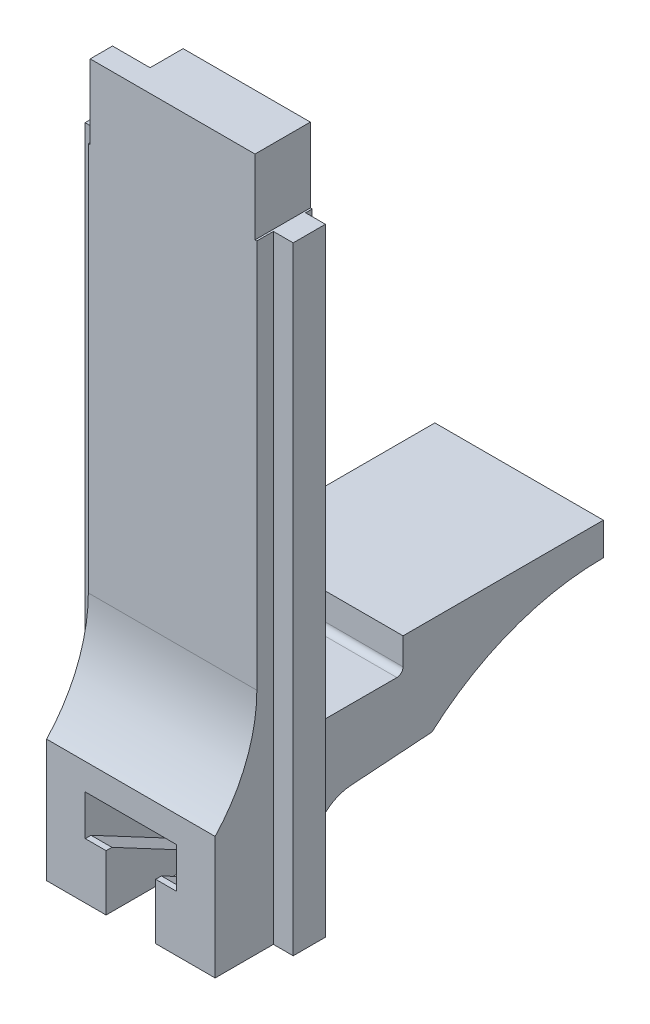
ISO-10303-21;
HEADER;
FILE_DESCRIPTION(('STEP AP214'),'2;1');
FILE_NAME('part.step','',(''),(''),'','','');
FILE_SCHEMA(('AUTOMOTIVE_DESIGN { 1 0 10303 214 1 1 1 1 }'));
ENDSEC;
DATA;
#1=APPLICATION_CONTEXT('core data for automotive mechanical design processes');
#2=APPLICATION_PROTOCOL_DEFINITION('international standard','automotive_design',2000,#1);
#3=PRODUCT_CONTEXT('',#1,'mechanical');
#4=PRODUCT('Part','Part','',(#3));
#5=PRODUCT_RELATED_PRODUCT_CATEGORY('part','',(#4));
#6=PRODUCT_DEFINITION_FORMATION('','',#4);
#7=PRODUCT_DEFINITION_CONTEXT('part definition',#1,'design');
#8=PRODUCT_DEFINITION('design','',#6,#7);
#9=PRODUCT_DEFINITION_SHAPE('','',#8);
#10=(LENGTH_UNIT() NAMED_UNIT(*) SI_UNIT(.MILLI.,.METRE.));
#11=(NAMED_UNIT(*) PLANE_ANGLE_UNIT() SI_UNIT($,.RADIAN.));
#12=(NAMED_UNIT(*) SI_UNIT($,.STERADIAN.) SOLID_ANGLE_UNIT());
#13=UNCERTAINTY_MEASURE_WITH_UNIT(LENGTH_MEASURE(1.E-05),#10,'distance_accuracy_value','');
#14=(GEOMETRIC_REPRESENTATION_CONTEXT(3) GLOBAL_UNCERTAINTY_ASSIGNED_CONTEXT((#13)) GLOBAL_UNIT_ASSIGNED_CONTEXT((#10,
#11,#12)) REPRESENTATION_CONTEXT('',''));
#15=CARTESIAN_POINT('',(0.,0.,0.));
#16=DIRECTION('',(0.,0.,1.));
#17=DIRECTION('',(1.,0.,0.));
#18=AXIS2_PLACEMENT_3D('',#15,#16,#17);
#19=CARTESIAN_POINT('',(-5.0673,42.545,5.969));
#20=DIRECTION('',(1.,0.,0.));
#21=DIRECTION('',(0.,1.,0.));
#22=AXIS2_PLACEMENT_3D('',#19,#20,#21);
#23=PLANE('',#22);
#24=DIRECTION('',(0.,0.,-1.));
#25=VECTOR('',#24,1.);
#26=CARTESIAN_POINT('',(-5.0673,42.545,5.969));
#27=LINE('',#26,#25);
#28=CARTESIAN_POINT('',(-5.0673,42.545,3.4036));
#29=VERTEX_POINT('',#28);
#30=CARTESIAN_POINT('',(-5.0673,42.545,2.032));
#31=VERTEX_POINT('',#30);
#32=EDGE_CURVE('E428',#29,#31,#27,.T.);
#33=ORIENTED_EDGE('',*,*,#32,.T.);
#34=DIRECTION('',(0.,1.,0.));
#35=VECTOR('',#34,1.);
#36=CARTESIAN_POINT('',(-5.0673,42.545,2.032));
#37=LINE('',#36,#35);
#38=CARTESIAN_POINT('',(-5.0673,38.1,2.032));
#39=VERTEX_POINT('',#38);
#40=EDGE_CURVE('E12',#39,#31,#37,.T.);
#41=ORIENTED_EDGE('',*,*,#40,.F.);
#42=DIRECTION('',(0.,0.,-1.));
#43=VECTOR('',#42,1.);
#44=CARTESIAN_POINT('',(-5.0673,38.1,5.969));
#45=LINE('',#44,#43);
#46=CARTESIAN_POINT('',(-5.0673,38.1,0.));
#47=VERTEX_POINT('',#46);
#48=EDGE_CURVE('E44',#39,#47,#45,.T.);
#49=ORIENTED_EDGE('',*,*,#48,.T.);
#50=DIRECTION('',(0.,-1.,0.));
#51=VECTOR('',#50,1.);
#52=CARTESIAN_POINT('',(-5.0673,42.545,0.));
#53=LINE('',#52,#51);
#54=CARTESIAN_POINT('',(-5.0673,37.973,0.));
#55=VERTEX_POINT('',#54);
#56=EDGE_CURVE('E414',#47,#55,#53,.T.);
#57=ORIENTED_EDGE('',*,*,#56,.T.);
#58=DIRECTION('',(0.,0.,-1.));
#59=VECTOR('',#58,1.);
#60=CARTESIAN_POINT('',(-5.0673,37.973,5.969));
#61=LINE('',#60,#59);
#62=CARTESIAN_POINT('',(-5.0673,37.973,3.4036));
#63=VERTEX_POINT('',#62);
#64=EDGE_CURVE('E422',#63,#55,#61,.T.);
#65=ORIENTED_EDGE('',*,*,#64,.F.);
#66=DIRECTION('',(0.,-1.,0.));
#67=VECTOR('',#66,1.);
#68=CARTESIAN_POINT('',(-5.06730000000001,14.0436698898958,3.4036));
#69=LINE('',#68,#67);
#70=EDGE_CURVE('E407',#29,#63,#69,.T.);
#71=ORIENTED_EDGE('',*,*,#70,.F.);
#72=EDGE_LOOP('',(#33,#41,#49,#57,#65,#71));
#73=FACE_BOUND('',#72,.T.);
#74=ADVANCED_FACE('F36',(#73),#23,.F.);
#75=CARTESIAN_POINT('',(5.1816,42.545,0.));
#76=DIRECTION('',(0.,0.,1.));
#77=DIRECTION('',(0.,-1.,0.));
#78=AXIS2_PLACEMENT_3D('',#75,#76,#77);
#79=PLANE('',#78);
#80=DIRECTION('',(-1.,0.,0.));
#81=VECTOR('',#80,1.);
#82=CARTESIAN_POINT('',(-6.4008,40.8432,0.));
#83=LINE('',#82,#81);
#84=CARTESIAN_POINT('',(4.2291,40.8432,0.));
#85=VERTEX_POINT('',#84);
#86=CARTESIAN_POINT('',(-2.7559,40.8432,0.));
#87=VERTEX_POINT('',#86);
#88=EDGE_CURVE('E344',#85,#87,#83,.T.);
#89=ORIENTED_EDGE('',*,*,#88,.T.);
#90=DIRECTION('',(0.,-1.,0.));
#91=VECTOR('',#90,1.);
#92=CARTESIAN_POINT('',(-2.7559,42.545,0.));
#93=LINE('',#92,#91);
#94=CARTESIAN_POINT('',(-2.7559,42.545,0.));
#95=VERTEX_POINT('',#94);
#96=EDGE_CURVE('E331',#95,#87,#93,.T.);
#97=ORIENTED_EDGE('',*,*,#96,.F.);
#98=DIRECTION('',(-1.,0.,0.));
#99=VECTOR('',#98,1.);
#100=CARTESIAN_POINT('',(5.1816,42.545,0.));
#101=LINE('',#100,#99);
#102=CARTESIAN_POINT('',(5.0673,42.545,0.));
#103=VERTEX_POINT('',#102);
#104=EDGE_CURVE('E342',#103,#95,#101,.T.);
#105=ORIENTED_EDGE('',*,*,#104,.F.);
#106=DIRECTION('',(0.,1.,0.));
#107=VECTOR('',#106,1.);
#108=CARTESIAN_POINT('',(5.0673,42.545,0.));
#109=LINE('',#108,#107);
#110=CARTESIAN_POINT('',(5.0673,37.973,0.));
#111=VERTEX_POINT('',#110);
#112=EDGE_CURVE('E443',#111,#103,#109,.T.);
#113=ORIENTED_EDGE('',*,*,#112,.F.);
#114=DIRECTION('',(-1.,0.,0.));
#115=VECTOR('',#114,1.);
#116=CARTESIAN_POINT('',(5.0673,37.973,0.));
#117=LINE('',#116,#115);
#118=CARTESIAN_POINT('',(5.1816,37.973,0.));
#119=VERTEX_POINT('',#118);
#120=EDGE_CURVE('E445',#119,#111,#117,.T.);
#121=ORIENTED_EDGE('',*,*,#120,.F.);
#122=DIRECTION('',(0.,1.,0.));
#123=VECTOR('',#122,1.);
#124=CARTESIAN_POINT('',(5.1816,42.545,0.));
#125=LINE('',#124,#123);
#126=CARTESIAN_POINT('',(5.1816,10.795,0.));
#127=VERTEX_POINT('',#126);
#128=EDGE_CURVE('E599',#127,#119,#125,.T.);
#129=ORIENTED_EDGE('',*,*,#128,.F.);
#130=DIRECTION('',(-1.,0.,0.));
#131=VECTOR('',#130,1.);
#132=CARTESIAN_POINT('',(5.1816,10.795,0.));
#133=LINE('',#132,#131);
#134=CARTESIAN_POINT('',(-5.1816,10.795,0.));
#135=VERTEX_POINT('',#134);
#136=EDGE_CURVE('E350',#127,#135,#133,.T.);
#137=ORIENTED_EDGE('',*,*,#136,.T.);
#138=DIRECTION('',(0.,1.,0.));
#139=VECTOR('',#138,1.);
#140=CARTESIAN_POINT('',(-5.1816,42.545,0.));
#141=LINE('',#140,#139);
#142=CARTESIAN_POINT('',(-5.1816,37.973,0.));
#143=VERTEX_POINT('',#142);
#144=EDGE_CURVE('E632',#135,#143,#141,.T.);
#145=ORIENTED_EDGE('',*,*,#144,.T.);
#146=DIRECTION('',(-1.,0.,0.));
#147=VECTOR('',#146,1.);
#148=CARTESIAN_POINT('',(-5.0673,37.973,0.));
#149=LINE('',#148,#147);
#150=EDGE_CURVE('E419',#55,#143,#149,.T.);
#151=ORIENTED_EDGE('',*,*,#150,.F.);
#152=ORIENTED_EDGE('',*,*,#56,.F.);
#153=DIRECTION('',(-1.,0.,0.));
#154=VECTOR('',#153,1.);
#155=CARTESIAN_POINT('',(-6.4008,38.1,0.));
#156=LINE('',#155,#154);
#157=CARTESIAN_POINT('',(4.2291,38.1,0.));
#158=VERTEX_POINT('',#157);
#159=EDGE_CURVE('E59',#158,#47,#156,.T.);
#160=ORIENTED_EDGE('',*,*,#159,.F.);
#161=DIRECTION('',(0.,-1.,0.));
#162=VECTOR('',#161,1.);
#163=CARTESIAN_POINT('',(4.2291,40.8432,0.));
#164=LINE('',#163,#162);
#165=EDGE_CURVE('E420',#85,#158,#164,.T.);
#166=ORIENTED_EDGE('',*,*,#165,.F.);
#167=EDGE_LOOP('',(#89,#97,#105,#113,#121,#129,#137,#145,#151,#152,#160,#166));
#168=FACE_BOUND('',#167,.T.);
#169=ADVANCED_FACE('F340',(#168),#79,.F.);
#170=CARTESIAN_POINT('',(5.1816,0.,0.));
#171=DIRECTION('',(0.,0.,1.));
#172=DIRECTION('',(1.,0.,0.));
#173=AXIS2_PLACEMENT_3D('',#170,#171,#172);
#174=PLANE('',#173);
#175=DIRECTION('',(0.,-1.,0.));
#176=VECTOR('',#175,1.);
#177=CARTESIAN_POINT('',(1.524,0.,0.));
#178=LINE('',#177,#176);
#179=CARTESIAN_POINT('',(1.524,0.660399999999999,0.));
#180=VERTEX_POINT('',#179);
#181=CARTESIAN_POINT('',(1.524,0.,0.));
#182=VERTEX_POINT('',#181);
#183=EDGE_CURVE('E543',#180,#182,#178,.T.);
#184=ORIENTED_EDGE('',*,*,#183,.F.);
#185=DIRECTION('',(1.,0.,0.));
#186=VECTOR('',#185,1.);
#187=CARTESIAN_POINT('',(5.1816,0.660399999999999,0.));
#188=LINE('',#187,#186);
#189=CARTESIAN_POINT('',(2.8067,0.660399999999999,0.));
#190=VERTEX_POINT('',#189);
#191=EDGE_CURVE('E511',#180,#190,#188,.T.);
#192=ORIENTED_EDGE('',*,*,#191,.T.);
#193=DIRECTION('',(0.,1.,0.));
#194=VECTOR('',#193,1.);
#195=CARTESIAN_POINT('',(2.8067,0.,0.));
#196=LINE('',#195,#194);
#197=CARTESIAN_POINT('',(2.8067,3.54961168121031,0.));
#198=VERTEX_POINT('',#197);
#199=EDGE_CURVE('E523',#190,#198,#196,.T.);
#200=ORIENTED_EDGE('',*,*,#199,.T.);
#201=DIRECTION('',(-1.,0.,0.));
#202=VECTOR('',#201,1.);
#203=CARTESIAN_POINT('',(5.1816,3.54961168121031,0.));
#204=LINE('',#203,#202);
#205=CARTESIAN_POINT('',(5.1816,3.54961168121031,0.));
#206=VERTEX_POINT('',#205);
#207=EDGE_CURVE('E385',#206,#198,#204,.T.);
#208=ORIENTED_EDGE('',*,*,#207,.F.);
#209=DIRECTION('',(0.,1.,0.));
#210=VECTOR('',#209,1.);
#211=CARTESIAN_POINT('',(5.1816,0.,0.));
#212=LINE('',#211,#210);
#213=CARTESIAN_POINT('',(5.1816,0.,0.));
#214=VERTEX_POINT('',#213);
#215=EDGE_CURVE('E577',#214,#206,#212,.T.);
#216=ORIENTED_EDGE('',*,*,#215,.F.);
#217=DIRECTION('',(-1.,0.,0.));
#218=VECTOR('',#217,1.);
#219=CARTESIAN_POINT('',(5.1816,0.,0.));
#220=LINE('',#219,#218);
#221=EDGE_CURVE('E644',#214,#182,#220,.T.);
#222=ORIENTED_EDGE('',*,*,#221,.T.);
#223=EDGE_LOOP('',(#184,#192,#200,#208,#216,#222));
#224=FACE_BOUND('',#223,.T.);
#225=ADVANCED_FACE('F767',(#224),#174,.F.);
#226=CARTESIAN_POINT('',(5.1816,0.,0.));
#227=DIRECTION('',(0.,1.,0.));
#228=DIRECTION('',(0.,0.,1.));
#229=AXIS2_PLACEMENT_3D('',#226,#227,#228);
#230=PLANE('',#229);
#231=DIRECTION('',(0.,0.,-1.));
#232=VECTOR('',#231,1.);
#233=CARTESIAN_POINT('',(1.524,0.,-17.907));
#234=LINE('',#233,#232);
#235=CARTESIAN_POINT('',(1.524,0.,5.96899999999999));
#236=VERTEX_POINT('',#235);
#237=EDGE_CURVE('E535',#236,#182,#234,.T.);
#238=ORIENTED_EDGE('',*,*,#237,.T.);
#239=ORIENTED_EDGE('',*,*,#221,.F.);
#240=DIRECTION('',(0.,0.,-1.));
#241=VECTOR('',#240,1.);
#242=CARTESIAN_POINT('',(5.1816,0.,0.));
#243=LINE('',#242,#241);
#244=CARTESIAN_POINT('',(5.1816,0.,0.406399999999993));
#245=VERTEX_POINT('',#244);
#246=EDGE_CURVE('E608',#245,#214,#243,.T.);
#247=ORIENTED_EDGE('',*,*,#246,.F.);
#248=DIRECTION('',(1.,0.,0.));
#249=VECTOR('',#248,1.);
#250=CARTESIAN_POINT('',(6.4008,0.,0.406399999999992));
#251=LINE('',#250,#249);
#252=CARTESIAN_POINT('',(6.4008,0.,0.406399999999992));
#253=VERTEX_POINT('',#252);
#254=EDGE_CURVE('E559',#245,#253,#251,.T.);
#255=ORIENTED_EDGE('',*,*,#254,.T.);
#256=DIRECTION('',(0.,0.,1.));
#257=VECTOR('',#256,1.);
#258=CARTESIAN_POINT('',(6.4008,0.,2.38759999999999));
#259=LINE('',#258,#257);
#260=CARTESIAN_POINT('',(6.4008,0.,2.38759999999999));
#261=VERTEX_POINT('',#260);
#262=EDGE_CURVE('E549',#253,#261,#259,.T.);
#263=ORIENTED_EDGE('',*,*,#262,.T.);
#264=DIRECTION('',(-1.,0.,0.));
#265=VECTOR('',#264,1.);
#266=CARTESIAN_POINT('',(6.4008,0.,2.38759999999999));
#267=LINE('',#266,#265);
#268=CARTESIAN_POINT('',(5.1816,0.,2.38759999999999));
#269=VERTEX_POINT('',#268);
#270=EDGE_CURVE('E553',#261,#269,#267,.T.);
#271=ORIENTED_EDGE('',*,*,#270,.T.);
#272=CARTESIAN_POINT('',(5.1816,0.,5.96899999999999));
#273=VERTEX_POINT('',#272);
#274=EDGE_CURVE('E609',#273,#269,#243,.T.);
#275=ORIENTED_EDGE('',*,*,#274,.F.);
#276=DIRECTION('',(-1.,0.,0.));
#277=VECTOR('',#276,1.);
#278=CARTESIAN_POINT('',(5.1816,0.,5.96899999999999));
#279=LINE('',#278,#277);
#280=EDGE_CURVE('E648',#273,#236,#279,.T.);
#281=ORIENTED_EDGE('',*,*,#280,.T.);
#282=EDGE_LOOP('',(#238,#239,#247,#255,#263,#271,#275,#281));
#283=FACE_BOUND('',#282,.T.);
#284=ADVANCED_FACE('F828',(#283),#230,.F.);
#285=CARTESIAN_POINT('',(5.1816,3.54961168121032,-2.54));
#286=DIRECTION('',(-1.,0.,0.));
#287=DIRECTION('',(0.,0.,1.));
#288=AXIS2_PLACEMENT_3D('',#285,#286,#287);
#289=PLANE('',#288);
#290=ORIENTED_EDGE('',*,*,#128,.T.);
#291=DIRECTION('',(0.,0.,1.));
#292=VECTOR('',#291,1.);
#293=CARTESIAN_POINT('',(5.1816,37.973,-2.54));
#294=LINE('',#293,#292);
#295=CARTESIAN_POINT('',(5.1816,37.973,0.406399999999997));
#296=VERTEX_POINT('',#295);
#297=EDGE_CURVE('E461',#119,#296,#294,.T.);
#298=ORIENTED_EDGE('',*,*,#297,.T.);
#299=DIRECTION('',(0.,-1.,0.));
#300=VECTOR('',#299,1.);
#301=CARTESIAN_POINT('',(5.1816,3.54961168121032,0.406399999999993));
#302=LINE('',#301,#300);
#303=EDGE_CURVE('E574',#296,#245,#302,.T.);
#304=ORIENTED_EDGE('',*,*,#303,.T.);
#305=ORIENTED_EDGE('',*,*,#246,.T.);
#306=ORIENTED_EDGE('',*,*,#215,.T.);
#307=CARTESIAN_POINT('',(5.1816,3.54961168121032,-2.54));
#308=DIRECTION('',(-1.,0.,0.));
#309=DIRECTION('',(0.,0.,1.));
#310=AXIS2_PLACEMENT_3D('',#307,#308,#309);
#311=CIRCLE('',#310,2.54);
#312=CARTESIAN_POINT('',(5.1816,6.08342436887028,-2.36281855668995));
#313=VERTEX_POINT('',#312);
#314=EDGE_CURVE('E580',#206,#313,#311,.T.);
#315=ORIENTED_EDGE('',*,*,#314,.T.);
#316=DIRECTION('',(0.,0.0697564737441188,-0.997564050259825));
#317=VECTOR('',#316,1.);
#318=CARTESIAN_POINT('',(5.1816,6.08342436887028,-2.36281855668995));
#319=LINE('',#318,#317);
#320=CARTESIAN_POINT('',(5.1816,6.4331634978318,-7.36432111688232));
#321=VERTEX_POINT('',#320);
#322=EDGE_CURVE('E583',#313,#321,#319,.T.);
#323=ORIENTED_EDGE('',*,*,#322,.T.);
#324=CARTESIAN_POINT('',(5.1816,-5.4356,-17.907));
#325=DIRECTION('',(-1.,0.,0.));
#326=DIRECTION('',(0.,0.,1.));
#327=AXIS2_PLACEMENT_3D('',#324,#325,#326);
#328=CIRCLE('',#327,15.875);
#329=CARTESIAN_POINT('',(5.1816,10.4394,-17.907));
#330=VERTEX_POINT('',#329);
#331=EDGE_CURVE('E585',#321,#330,#328,.T.);
#332=ORIENTED_EDGE('',*,*,#331,.T.);
#333=DIRECTION('',(0.,1.,0.));
#334=VECTOR('',#333,1.);
#335=CARTESIAN_POINT('',(5.1816,12.446,-17.907));
#336=LINE('',#335,#334);
#337=CARTESIAN_POINT('',(5.1816,12.446,-17.907));
#338=VERTEX_POINT('',#337);
#339=EDGE_CURVE('E587',#330,#338,#336,.T.);
#340=ORIENTED_EDGE('',*,*,#339,.T.);
#341=DIRECTION('',(0.,0.,1.));
#342=VECTOR('',#341,1.);
#343=CARTESIAN_POINT('',(5.1816,12.446,-5.588));
#344=LINE('',#343,#342);
#345=CARTESIAN_POINT('',(5.1816,12.446,-5.588));
#346=VERTEX_POINT('',#345);
#347=EDGE_CURVE('E589',#338,#346,#344,.T.);
#348=ORIENTED_EDGE('',*,*,#347,.T.);
#349=DIRECTION('',(0.,-1.,0.));
#350=VECTOR('',#349,1.);
#351=CARTESIAN_POINT('',(5.1816,10.795,-5.588));
#352=LINE('',#351,#350);
#353=CARTESIAN_POINT('',(5.1816,10.795,-5.588));
#354=VERTEX_POINT('',#353);
#355=EDGE_CURVE('E591',#346,#354,#352,.T.);
#356=ORIENTED_EDGE('',*,*,#355,.T.);
#357=CARTESIAN_POINT('',(5.1816,10.795,-5.207));
#358=DIRECTION('',(-1.,0.,0.));
#359=DIRECTION('',(0.,0.,-1.));
#360=AXIS2_PLACEMENT_3D('',#357,#358,#359);
#361=CIRCLE('',#360,0.381);
#362=CARTESIAN_POINT('',(5.1816,10.414,-5.207));
#363=VERTEX_POINT('',#362);
#364=EDGE_CURVE('E593',#354,#363,#361,.T.);
#365=ORIENTED_EDGE('',*,*,#364,.T.);
#366=DIRECTION('',(0.,0.,1.));
#367=VECTOR('',#366,1.);
#368=CARTESIAN_POINT('',(5.1816,10.414,-0.381000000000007));
#369=LINE('',#368,#367);
#370=CARTESIAN_POINT('',(5.1816,10.414,-0.381000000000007));
#371=VERTEX_POINT('',#370);
#372=EDGE_CURVE('E595',#363,#371,#369,.T.);
#373=ORIENTED_EDGE('',*,*,#372,.T.);
#374=CARTESIAN_POINT('',(5.1816,10.795,-0.381000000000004));
#375=DIRECTION('',(-1.,0.,0.));
#376=DIRECTION('',(0.,0.,-1.));
#377=AXIS2_PLACEMENT_3D('',#374,#375,#376);
#378=CIRCLE('',#377,0.381);
#379=EDGE_CURVE('E597',#371,#127,#378,.T.);
#380=ORIENTED_EDGE('',*,*,#379,.T.);
#381=EDGE_LOOP('',(#290,#298,#304,#305,#306,#315,#323,#332,#340,#348,#356,#365,#373,#380));
#382=FACE_BOUND('',#381,.T.);
#383=ADVANCED_FACE('F690',(#382),#289,.F.);
#384=CARTESIAN_POINT('',(-5.1816,3.54961168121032,-2.54));
#385=DIRECTION('',(-1.,0.,0.));
#386=DIRECTION('',(0.,0.,1.));
#387=AXIS2_PLACEMENT_3D('',#384,#385,#386);
#388=PLANE('',#387);
#389=DIRECTION('',(0.,0.,1.));
#390=VECTOR('',#389,1.);
#391=CARTESIAN_POINT('',(-5.1816,37.973,-2.54));
#392=LINE('',#391,#390);
#393=CARTESIAN_POINT('',(-5.1816,37.973,0.406399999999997));
#394=VERTEX_POINT('',#393);
#395=EDGE_CURVE('E430',#143,#394,#392,.T.);
#396=ORIENTED_EDGE('',*,*,#395,.F.);
#397=ORIENTED_EDGE('',*,*,#144,.F.);
#398=CARTESIAN_POINT('',(-5.1816,10.795,-0.381000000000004));
#399=DIRECTION('',(-1.,0.,0.));
#400=DIRECTION('',(0.,0.,-1.));
#401=AXIS2_PLACEMENT_3D('',#398,#399,#400);
#402=CIRCLE('',#401,0.381);
#403=CARTESIAN_POINT('',(-5.1816,10.414,-0.381000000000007));
#404=VERTEX_POINT('',#403);
#405=EDGE_CURVE('E630',#404,#135,#402,.T.);
#406=ORIENTED_EDGE('',*,*,#405,.F.);
#407=DIRECTION('',(0.,0.,1.));
#408=VECTOR('',#407,1.);
#409=CARTESIAN_POINT('',(-5.1816,10.414,-0.381000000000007));
#410=LINE('',#409,#408);
#411=CARTESIAN_POINT('',(-5.1816,10.414,-5.207));
#412=VERTEX_POINT('',#411);
#413=EDGE_CURVE('E628',#412,#404,#410,.T.);
#414=ORIENTED_EDGE('',*,*,#413,.F.);
#415=CARTESIAN_POINT('',(-5.1816,10.795,-5.207));
#416=DIRECTION('',(-1.,0.,0.));
#417=DIRECTION('',(0.,0.,-1.));
#418=AXIS2_PLACEMENT_3D('',#415,#416,#417);
#419=CIRCLE('',#418,0.381);
#420=CARTESIAN_POINT('',(-5.1816,10.795,-5.588));
#421=VERTEX_POINT('',#420);
#422=EDGE_CURVE('E626',#421,#412,#419,.T.);
#423=ORIENTED_EDGE('',*,*,#422,.F.);
#424=DIRECTION('',(0.,-1.,0.));
#425=VECTOR('',#424,1.);
#426=CARTESIAN_POINT('',(-5.1816,10.795,-5.588));
#427=LINE('',#426,#425);
#428=CARTESIAN_POINT('',(-5.1816,12.446,-5.588));
#429=VERTEX_POINT('',#428);
#430=EDGE_CURVE('E624',#429,#421,#427,.T.);
#431=ORIENTED_EDGE('',*,*,#430,.F.);
#432=DIRECTION('',(0.,0.,1.));
#433=VECTOR('',#432,1.);
#434=CARTESIAN_POINT('',(-5.1816,12.446,-5.588));
#435=LINE('',#434,#433);
#436=CARTESIAN_POINT('',(-5.1816,12.446,-17.907));
#437=VERTEX_POINT('',#436);
#438=EDGE_CURVE('E622',#437,#429,#435,.T.);
#439=ORIENTED_EDGE('',*,*,#438,.F.);
#440=DIRECTION('',(0.,1.,0.));
#441=VECTOR('',#440,1.);
#442=CARTESIAN_POINT('',(-5.1816,12.446,-17.907));
#443=LINE('',#442,#441);
#444=CARTESIAN_POINT('',(-5.1816,10.4394,-17.907));
#445=VERTEX_POINT('',#444);
#446=EDGE_CURVE('E620',#445,#437,#443,.T.);
#447=ORIENTED_EDGE('',*,*,#446,.F.);
#448=CARTESIAN_POINT('',(-5.1816,-5.4356,-17.907));
#449=DIRECTION('',(-1.,0.,0.));
#450=DIRECTION('',(0.,0.,1.));
#451=AXIS2_PLACEMENT_3D('',#448,#449,#450);
#452=CIRCLE('',#451,15.875);
#453=CARTESIAN_POINT('',(-5.1816,6.4331634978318,-7.36432111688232));
#454=VERTEX_POINT('',#453);
#455=EDGE_CURVE('E618',#454,#445,#452,.T.);
#456=ORIENTED_EDGE('',*,*,#455,.F.);
#457=DIRECTION('',(0.,0.0697564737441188,-0.997564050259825));
#458=VECTOR('',#457,1.);
#459=CARTESIAN_POINT('',(-5.1816,6.08342436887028,-2.36281855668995));
#460=LINE('',#459,#458);
#461=CARTESIAN_POINT('',(-5.1816,6.08342436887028,-2.36281855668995));
#462=VERTEX_POINT('',#461);
#463=EDGE_CURVE('E616',#462,#454,#460,.T.);
#464=ORIENTED_EDGE('',*,*,#463,.F.);
#465=CARTESIAN_POINT('',(-5.1816,3.54961168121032,-2.54));
#466=DIRECTION('',(-1.,0.,0.));
#467=DIRECTION('',(0.,0.,1.));
#468=AXIS2_PLACEMENT_3D('',#465,#466,#467);
#469=CIRCLE('',#468,2.54);
#470=CARTESIAN_POINT('',(-5.1816,3.54961168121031,0.));
#471=VERTEX_POINT('',#470);
#472=EDGE_CURVE('E614',#471,#462,#469,.T.);
#473=ORIENTED_EDGE('',*,*,#472,.F.);
#474=DIRECTION('',(0.,1.,0.));
#475=VECTOR('',#474,1.);
#476=CARTESIAN_POINT('',(-5.1816,0.,0.));
#477=LINE('',#476,#475);
#478=CARTESIAN_POINT('',(-5.1816,0.,0.));
#479=VERTEX_POINT('',#478);
#480=EDGE_CURVE('E576',#479,#471,#477,.T.);
#481=ORIENTED_EDGE('',*,*,#480,.F.);
#482=DIRECTION('',(0.,0.,-1.));
#483=VECTOR('',#482,1.);
#484=CARTESIAN_POINT('',(-5.1816,0.,0.));
#485=LINE('',#484,#483);
#486=CARTESIAN_POINT('',(-5.1816,0.,0.406399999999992));
#487=VERTEX_POINT('',#486);
#488=EDGE_CURVE('E641',#487,#479,#485,.T.);
#489=ORIENTED_EDGE('',*,*,#488,.F.);
#490=DIRECTION('',(0.,-1.,0.));
#491=VECTOR('',#490,1.);
#492=CARTESIAN_POINT('',(-5.1816,3.54961168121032,0.406399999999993));
#493=LINE('',#492,#491);
#494=EDGE_CURVE('E391',#394,#487,#493,.T.);
#495=ORIENTED_EDGE('',*,*,#494,.F.);
#496=EDGE_LOOP('',(#396,#397,#406,#414,#423,#431,#439,#447,#456,#464,#473,#481,#489,#495));
#497=FACE_BOUND('',#496,.T.);
#498=ADVANCED_FACE('F702',(#497),#388,.T.);
#499=DIRECTION('',(0.,1.,0.));
#500=VECTOR('',#499,1.);
#501=CARTESIAN_POINT('',(-2.8067,0.,0.));
#502=LINE('',#501,#500);
#503=CARTESIAN_POINT('',(-2.8067,0.660399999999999,0.));
#504=VERTEX_POINT('',#503);
#505=CARTESIAN_POINT('',(-2.8067,3.54961168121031,0.));
#506=VERTEX_POINT('',#505);
#507=EDGE_CURVE('E529',#504,#506,#502,.T.);
#508=ORIENTED_EDGE('',*,*,#507,.F.);
#509=DIRECTION('',(1.,0.,0.));
#510=VECTOR('',#509,1.);
#511=CARTESIAN_POINT('',(5.1816,0.660399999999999,0.));
#512=LINE('',#511,#510);
#513=CARTESIAN_POINT('',(-1.524,0.660399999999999,0.));
#514=VERTEX_POINT('',#513);
#515=EDGE_CURVE('E517',#504,#514,#512,.T.);
#516=ORIENTED_EDGE('',*,*,#515,.T.);
#517=DIRECTION('',(0.,-1.,0.));
#518=VECTOR('',#517,1.);
#519=CARTESIAN_POINT('',(-1.524,0.,0.));
#520=LINE('',#519,#518);
#521=CARTESIAN_POINT('',(-1.524,0.,0.));
#522=VERTEX_POINT('',#521);
#523=EDGE_CURVE('E545',#514,#522,#520,.T.);
#524=ORIENTED_EDGE('',*,*,#523,.T.);
#525=EDGE_CURVE('E611',#522,#479,#220,.T.);
#526=ORIENTED_EDGE('',*,*,#525,.T.);
#527=ORIENTED_EDGE('',*,*,#480,.T.);
#528=EDGE_CURVE('E384',#506,#471,#204,.T.);
#529=ORIENTED_EDGE('',*,*,#528,.F.);
#530=EDGE_LOOP('',(#508,#516,#524,#526,#527,#529));
#531=FACE_BOUND('',#530,.T.);
#532=ADVANCED_FACE('F38',(#531),#174,.F.);
#533=CARTESIAN_POINT('',(5.1816,3.54961168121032,-2.54));
#534=DIRECTION('',(-1.,0.,0.));
#535=DIRECTION('',(0.,0.,1.));
#536=AXIS2_PLACEMENT_3D('',#533,#534,#535);
#537=CYLINDRICAL_SURFACE('',#536,2.54);
#538=DIRECTION('',(-1.,0.,0.));
#539=VECTOR('',#538,1.);
#540=CARTESIAN_POINT('',(5.1816,5.9182,-1.62272720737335));
#541=LINE('',#540,#539);
#542=CARTESIAN_POINT('',(2.8067,5.9182,-1.62272720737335));
#543=VERTEX_POINT('',#542);
#544=CARTESIAN_POINT('',(-2.8067,5.9182,-1.62272720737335));
#545=VERTEX_POINT('',#544);
#546=EDGE_CURVE('E547',#543,#545,#541,.T.);
#547=ORIENTED_EDGE('',*,*,#546,.T.);
#548=CARTESIAN_POINT('',(-2.8067,3.54961168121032,-2.54));
#549=DIRECTION('',(1.,0.,0.));
#550=DIRECTION('',(0.,0.,-1.));
#551=AXIS2_PLACEMENT_3D('',#548,#549,#550);
#552=CIRCLE('',#551,2.54);
#553=EDGE_CURVE('E526',#506,#545,#552,.F.);
#554=ORIENTED_EDGE('',*,*,#553,.F.);
#555=ORIENTED_EDGE('',*,*,#528,.T.);
#556=ORIENTED_EDGE('',*,*,#472,.T.);
#557=DIRECTION('',(-1.,0.,0.));
#558=VECTOR('',#557,1.);
#559=CARTESIAN_POINT('',(5.1816,6.08342436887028,-2.36281855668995));
#560=LINE('',#559,#558);
#561=EDGE_CURVE('E381',#313,#462,#560,.T.);
#562=ORIENTED_EDGE('',*,*,#561,.F.);
#563=ORIENTED_EDGE('',*,*,#314,.F.);
#564=ORIENTED_EDGE('',*,*,#207,.T.);
#565=CARTESIAN_POINT('',(2.8067,3.54961168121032,-2.54));
#566=DIRECTION('',(1.,0.,0.));
#567=DIRECTION('',(0.,0.,-1.));
#568=AXIS2_PLACEMENT_3D('',#565,#566,#567);
#569=CIRCLE('',#568,2.54);
#570=EDGE_CURVE('E520',#198,#543,#569,.F.);
#571=ORIENTED_EDGE('',*,*,#570,.T.);
#572=EDGE_LOOP('',(#547,#554,#555,#556,#562,#563,#564,#571));
#573=FACE_BOUND('',#572,.T.);
#574=ADVANCED_FACE('F865',(#573),#537,.F.);
#575=CARTESIAN_POINT('',(5.1816,6.08342436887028,-2.36281855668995));
#576=DIRECTION('',(0.,0.997564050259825,0.0697564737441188));
#577=DIRECTION('',(0.,-0.0697564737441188,0.997564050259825));
#578=AXIS2_PLACEMENT_3D('',#575,#576,#577);
#579=PLANE('',#578);
#580=ORIENTED_EDGE('',*,*,#463,.T.);
#581=DIRECTION('',(-1.,0.,0.));
#582=VECTOR('',#581,1.);
#583=CARTESIAN_POINT('',(5.1816,6.4331634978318,-7.36432111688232));
#584=LINE('',#583,#582);
#585=EDGE_CURVE('E378',#321,#454,#584,.T.);
#586=ORIENTED_EDGE('',*,*,#585,.F.);
#587=ORIENTED_EDGE('',*,*,#322,.F.);
#588=ORIENTED_EDGE('',*,*,#561,.T.);
#589=EDGE_LOOP('',(#580,#586,#587,#588));
#590=FACE_BOUND('',#589,.T.);
#591=ADVANCED_FACE('F862',(#590),#579,.F.);
#592=CARTESIAN_POINT('',(5.1816,-5.4356,-17.907));
#593=DIRECTION('',(-1.,0.,0.));
#594=DIRECTION('',(0.,0.,1.));
#595=AXIS2_PLACEMENT_3D('',#592,#593,#594);
#596=CYLINDRICAL_SURFACE('',#595,15.875);
#597=ORIENTED_EDGE('',*,*,#455,.T.);
#598=DIRECTION('',(-1.,0.,0.));
#599=VECTOR('',#598,1.);
#600=CARTESIAN_POINT('',(5.1816,10.4394,-17.907));
#601=LINE('',#600,#599);
#602=EDGE_CURVE('E375',#330,#445,#601,.T.);
#603=ORIENTED_EDGE('',*,*,#602,.F.);
#604=ORIENTED_EDGE('',*,*,#331,.F.);
#605=ORIENTED_EDGE('',*,*,#585,.T.);
#606=EDGE_LOOP('',(#597,#603,#604,#605));
#607=FACE_BOUND('',#606,.T.);
#608=ADVANCED_FACE('F858',(#607),#596,.F.);
#609=CARTESIAN_POINT('',(5.1816,12.446,-17.907));
#610=DIRECTION('',(0.,0.,1.));
#611=DIRECTION('',(1.,0.,0.));
#612=AXIS2_PLACEMENT_3D('',#609,#610,#611);
#613=PLANE('',#612);
#614=ORIENTED_EDGE('',*,*,#446,.T.);
#615=DIRECTION('',(-1.,0.,0.));
#616=VECTOR('',#615,1.);
#617=CARTESIAN_POINT('',(5.1816,12.446,-17.907));
#618=LINE('',#617,#616);
#619=EDGE_CURVE('E372',#338,#437,#618,.T.);
#620=ORIENTED_EDGE('',*,*,#619,.F.);
#621=ORIENTED_EDGE('',*,*,#339,.F.);
#622=ORIENTED_EDGE('',*,*,#602,.T.);
#623=EDGE_LOOP('',(#614,#620,#621,#622));
#624=FACE_BOUND('',#623,.T.);
#625=ADVANCED_FACE('F854',(#624),#613,.F.);
#626=CARTESIAN_POINT('',(5.1816,12.446,-5.588));
#627=DIRECTION('',(0.,-1.,0.));
#628=DIRECTION('',(0.,0.,-1.));
#629=AXIS2_PLACEMENT_3D('',#626,#627,#628);
#630=PLANE('',#629);
#631=ORIENTED_EDGE('',*,*,#438,.T.);
#632=DIRECTION('',(-1.,0.,0.));
#633=VECTOR('',#632,1.);
#634=CARTESIAN_POINT('',(5.1816,12.446,-5.588));
#635=LINE('',#634,#633);
#636=EDGE_CURVE('E369',#346,#429,#635,.T.);
#637=ORIENTED_EDGE('',*,*,#636,.F.);
#638=ORIENTED_EDGE('',*,*,#347,.F.);
#639=ORIENTED_EDGE('',*,*,#619,.T.);
#640=EDGE_LOOP('',(#631,#637,#638,#639));
#641=FACE_BOUND('',#640,.T.);
#642=ADVANCED_FACE('F850',(#641),#630,.F.);
#643=CARTESIAN_POINT('',(5.1816,10.795,-5.588));
#644=DIRECTION('',(0.,0.,-1.));
#645=DIRECTION('',(-1.,0.,0.));
#646=AXIS2_PLACEMENT_3D('',#643,#644,#645);
#647=PLANE('',#646);
#648=ORIENTED_EDGE('',*,*,#430,.T.);
#649=DIRECTION('',(-1.,0.,0.));
#650=VECTOR('',#649,1.);
#651=CARTESIAN_POINT('',(5.1816,10.795,-5.588));
#652=LINE('',#651,#650);
#653=EDGE_CURVE('E366',#354,#421,#652,.T.);
#654=ORIENTED_EDGE('',*,*,#653,.F.);
#655=ORIENTED_EDGE('',*,*,#355,.F.);
#656=ORIENTED_EDGE('',*,*,#636,.T.);
#657=EDGE_LOOP('',(#648,#654,#655,#656));
#658=FACE_BOUND('',#657,.T.);
#659=ADVANCED_FACE('F846',(#658),#647,.F.);
#660=CARTESIAN_POINT('',(5.1816,10.795,-5.207));
#661=DIRECTION('',(-1.,0.,0.));
#662=DIRECTION('',(0.,0.,1.));
#663=AXIS2_PLACEMENT_3D('',#660,#661,#662);
#664=CYLINDRICAL_SURFACE('',#663,0.381);
#665=ORIENTED_EDGE('',*,*,#422,.T.);
#666=DIRECTION('',(-1.,0.,0.));
#667=VECTOR('',#666,1.);
#668=CARTESIAN_POINT('',(5.1816,10.414,-5.207));
#669=LINE('',#668,#667);
#670=EDGE_CURVE('E363',#363,#412,#669,.T.);
#671=ORIENTED_EDGE('',*,*,#670,.F.);
#672=ORIENTED_EDGE('',*,*,#364,.F.);
#673=ORIENTED_EDGE('',*,*,#653,.T.);
#674=EDGE_LOOP('',(#665,#671,#672,#673));
#675=FACE_BOUND('',#674,.T.);
#676=ADVANCED_FACE('F842',(#675),#664,.F.);
#677=CARTESIAN_POINT('',(5.1816,10.414,-0.381000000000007));
#678=DIRECTION('',(0.,-1.,0.));
#679=DIRECTION('',(0.,0.,-1.));
#680=AXIS2_PLACEMENT_3D('',#677,#678,#679);
#681=PLANE('',#680);
#682=ORIENTED_EDGE('',*,*,#413,.T.);
#683=DIRECTION('',(-1.,0.,0.));
#684=VECTOR('',#683,1.);
#685=CARTESIAN_POINT('',(5.1816,10.414,-0.381000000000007));
#686=LINE('',#685,#684);
#687=EDGE_CURVE('E354',#371,#404,#686,.T.);
#688=ORIENTED_EDGE('',*,*,#687,.F.);
#689=ORIENTED_EDGE('',*,*,#372,.F.);
#690=ORIENTED_EDGE('',*,*,#670,.T.);
#691=EDGE_LOOP('',(#682,#688,#689,#690));
#692=FACE_BOUND('',#691,.T.);
#693=ADVANCED_FACE('F839',(#692),#681,.F.);
#694=CARTESIAN_POINT('',(5.1816,10.795,-0.381000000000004));
#695=DIRECTION('',(-1.,0.,0.));
#696=DIRECTION('',(0.,0.,1.));
#697=AXIS2_PLACEMENT_3D('',#694,#695,#696);
#698=CYLINDRICAL_SURFACE('',#697,0.381);
#699=ORIENTED_EDGE('',*,*,#405,.T.);
#700=ORIENTED_EDGE('',*,*,#136,.F.);
#701=ORIENTED_EDGE('',*,*,#379,.F.);
#702=ORIENTED_EDGE('',*,*,#687,.T.);
#703=EDGE_LOOP('',(#699,#700,#701,#702));
#704=FACE_BOUND('',#703,.T.);
#705=ADVANCED_FACE('F697',(#704),#698,.F.);
#706=CARTESIAN_POINT('',(5.1816,42.545,3.4036));
#707=DIRECTION('',(0.,-1.,0.));
#708=DIRECTION('',(0.,0.,-1.));
#709=AXIS2_PLACEMENT_3D('',#706,#707,#708);
#710=PLANE('',#709);
#711=ORIENTED_EDGE('',*,*,#104,.T.);
#712=DIRECTION('',(0.,0.,-1.));
#713=VECTOR('',#712,1.);
#714=CARTESIAN_POINT('',(-2.7559,42.545,7.04204939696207));
#715=LINE('',#714,#713);
#716=CARTESIAN_POINT('',(-2.7559,42.545,2.032));
#717=VERTEX_POINT('',#716);
#718=EDGE_CURVE('E328',#717,#95,#715,.T.);
#719=ORIENTED_EDGE('',*,*,#718,.F.);
#720=DIRECTION('',(-1.,0.,0.));
#721=VECTOR('',#720,1.);
#722=CARTESIAN_POINT('',(-5.0673,42.545,2.032));
#723=LINE('',#722,#721);
#724=EDGE_CURVE('E726',#717,#31,#723,.T.);
#725=ORIENTED_EDGE('',*,*,#724,.T.);
#726=ORIENTED_EDGE('',*,*,#32,.F.);
#727=DIRECTION('',(-1.,0.,0.));
#728=VECTOR('',#727,1.);
#729=CARTESIAN_POINT('',(5.1816,42.545,3.4036));
#730=LINE('',#729,#728);
#731=CARTESIAN_POINT('',(5.0673,42.545,3.4036));
#732=VERTEX_POINT('',#731);
#733=EDGE_CURVE('E351',#732,#29,#730,.T.);
#734=ORIENTED_EDGE('',*,*,#733,.F.);
#735=DIRECTION('',(0.,0.,-1.));
#736=VECTOR('',#735,1.);
#737=CARTESIAN_POINT('',(5.0673,42.545,5.969));
#738=LINE('',#737,#736);
#739=EDGE_CURVE('E349',#732,#103,#738,.T.);
#740=ORIENTED_EDGE('',*,*,#739,.T.);
#741=EDGE_LOOP('',(#711,#719,#725,#726,#734,#740));
#742=FACE_BOUND('',#741,.T.);
#743=ADVANCED_FACE('F347',(#742),#710,.F.);
#744=CARTESIAN_POINT('',(5.1816,14.0436698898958,3.4036));
#745=DIRECTION('',(0.,0.,-1.));
#746=DIRECTION('',(0.,1.,0.));
#747=AXIS2_PLACEMENT_3D('',#744,#745,#746);
#748=PLANE('',#747);
#749=ORIENTED_EDGE('',*,*,#733,.T.);
#750=ORIENTED_EDGE('',*,*,#70,.T.);
#751=DIRECTION('',(-1.,0.,0.));
#752=VECTOR('',#751,1.);
#753=CARTESIAN_POINT('',(5.1816,37.973,3.4036));
#754=LINE('',#753,#752);
#755=CARTESIAN_POINT('',(-5.1816,37.973,3.4036));
#756=VERTEX_POINT('',#755);
#757=EDGE_CURVE('E440',#63,#756,#754,.T.);
#758=ORIENTED_EDGE('',*,*,#757,.T.);
#759=DIRECTION('',(0.,-1.,0.));
#760=VECTOR('',#759,1.);
#761=CARTESIAN_POINT('',(-5.1816,14.0436698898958,3.4036));
#762=LINE('',#761,#760);
#763=CARTESIAN_POINT('',(-5.1816,14.0436698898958,3.4036));
#764=VERTEX_POINT('',#763);
#765=EDGE_CURVE('E634',#756,#764,#762,.T.);
#766=ORIENTED_EDGE('',*,*,#765,.T.);
#767=DIRECTION('',(-1.,0.,0.));
#768=VECTOR('',#767,1.);
#769=CARTESIAN_POINT('',(5.1816,14.0436698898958,3.4036));
#770=LINE('',#769,#768);
#771=CARTESIAN_POINT('',(5.1816,14.0436698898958,3.4036));
#772=VERTEX_POINT('',#771);
#773=EDGE_CURVE('E357',#772,#764,#770,.T.);
#774=ORIENTED_EDGE('',*,*,#773,.F.);
#775=DIRECTION('',(0.,-1.,0.));
#776=VECTOR('',#775,1.);
#777=CARTESIAN_POINT('',(5.1816,14.0436698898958,3.4036));
#778=LINE('',#777,#776);
#779=CARTESIAN_POINT('',(5.1816,37.973,3.4036));
#780=VERTEX_POINT('',#779);
#781=EDGE_CURVE('E602',#780,#772,#778,.T.);
#782=ORIENTED_EDGE('',*,*,#781,.F.);
#783=DIRECTION('',(-1.,0.,0.));
#784=VECTOR('',#783,1.);
#785=CARTESIAN_POINT('',(5.1816,37.973,3.4036));
#786=LINE('',#785,#784);
#787=CARTESIAN_POINT('',(5.0673,37.973,3.4036));
#788=VERTEX_POINT('',#787);
#789=EDGE_CURVE('E456',#780,#788,#786,.T.);
#790=ORIENTED_EDGE('',*,*,#789,.T.);
#791=DIRECTION('',(0.,1.,0.));
#792=VECTOR('',#791,1.);
#793=CARTESIAN_POINT('',(5.06730000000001,14.0436698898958,3.4036));
#794=LINE('',#793,#792);
#795=EDGE_CURVE('E402',#788,#732,#794,.T.);
#796=ORIENTED_EDGE('',*,*,#795,.T.);
#797=EDGE_LOOP('',(#749,#750,#758,#766,#774,#782,#790,#796));
#798=FACE_BOUND('',#797,.T.);
#799=ADVANCED_FACE('F680',(#798),#748,.F.);
#800=CARTESIAN_POINT('',(5.1816,14.0436698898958,12.9286));
#801=DIRECTION('',(-1.,0.,0.));
#802=DIRECTION('',(0.,0.,1.));
#803=AXIS2_PLACEMENT_3D('',#800,#801,#802);
#804=CYLINDRICAL_SURFACE('',#803,9.525);
#805=CARTESIAN_POINT('',(-5.1816,14.0436698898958,12.9286));
#806=DIRECTION('',(-1.,0.,0.));
#807=DIRECTION('',(0.,0.,-1.));
#808=AXIS2_PLACEMENT_3D('',#805,#806,#807);
#809=CIRCLE('',#808,9.525);
#810=CARTESIAN_POINT('',(-5.1816,7.540625,5.96899999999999));
#811=VERTEX_POINT('',#810);
#812=EDGE_CURVE('E636',#764,#811,#809,.T.);
#813=ORIENTED_EDGE('',*,*,#812,.T.);
#814=DIRECTION('',(-1.,0.,0.));
#815=VECTOR('',#814,1.);
#816=CARTESIAN_POINT('',(5.1816,7.540625,5.96899999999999));
#817=LINE('',#816,#815);
#818=CARTESIAN_POINT('',(5.1816,7.540625,5.96899999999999));
#819=VERTEX_POINT('',#818);
#820=EDGE_CURVE('E651',#819,#811,#817,.T.);
#821=ORIENTED_EDGE('',*,*,#820,.F.);
#822=CARTESIAN_POINT('',(5.1816,14.0436698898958,12.9286));
#823=DIRECTION('',(-1.,0.,0.));
#824=DIRECTION('',(0.,0.,-1.));
#825=AXIS2_PLACEMENT_3D('',#822,#823,#824);
#826=CIRCLE('',#825,9.525);
#827=EDGE_CURVE('E604',#772,#819,#826,.T.);
#828=ORIENTED_EDGE('',*,*,#827,.F.);
#829=ORIENTED_EDGE('',*,*,#773,.T.);
#830=EDGE_LOOP('',(#813,#821,#828,#829));
#831=FACE_BOUND('',#830,.T.);
#832=ADVANCED_FACE('F658',(#831),#804,.F.);
#833=CARTESIAN_POINT('',(5.1816,0.,5.96899999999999));
#834=DIRECTION('',(0.,0.,-1.));
#835=DIRECTION('',(-1.,0.,0.));
#836=AXIS2_PLACEMENT_3D('',#833,#834,#835);
#837=PLANE('',#836);
#838=DIRECTION('',(0.,-1.,0.));
#839=VECTOR('',#838,1.);
#840=CARTESIAN_POINT('',(-2.8067,5.9182,5.96899999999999));
#841=LINE('',#840,#839);
#842=CARTESIAN_POINT('',(-2.8067,5.9182,5.96899999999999));
#843=VERTEX_POINT('',#842);
#844=CARTESIAN_POINT('',(-2.8067,3.429,5.96899999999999));
#845=VERTEX_POINT('',#844);
#846=EDGE_CURVE('E468',#843,#845,#841,.T.);
#847=ORIENTED_EDGE('',*,*,#846,.F.);
#848=DIRECTION('',(1.,0.,0.));
#849=VECTOR('',#848,1.);
#850=CARTESIAN_POINT('',(-1.524,5.9182,5.96899999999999));
#851=LINE('',#850,#849);
#852=CARTESIAN_POINT('',(2.8067,5.9182,5.96899999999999));
#853=VERTEX_POINT('',#852);
#854=EDGE_CURVE('E538',#843,#853,#851,.T.);
#855=ORIENTED_EDGE('',*,*,#854,.T.);
#856=DIRECTION('',(0.,-1.,0.));
#857=VECTOR('',#856,1.);
#858=CARTESIAN_POINT('',(2.8067,5.9182,5.96899999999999));
#859=LINE('',#858,#857);
#860=CARTESIAN_POINT('',(2.8067,3.429,5.96899999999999));
#861=VERTEX_POINT('',#860);
#862=EDGE_CURVE('E484',#853,#861,#859,.T.);
#863=ORIENTED_EDGE('',*,*,#862,.T.);
#864=DIRECTION('',(1.,0.,0.));
#865=VECTOR('',#864,1.);
#866=CARTESIAN_POINT('',(-2.8067,3.429,5.96899999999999));
#867=LINE('',#866,#865);
#868=CARTESIAN_POINT('',(1.524,3.429,5.96899999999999));
#869=VERTEX_POINT('',#868);
#870=EDGE_CURVE('E481',#869,#861,#867,.T.);
#871=ORIENTED_EDGE('',*,*,#870,.F.);
#872=DIRECTION('',(0.,-1.,0.));
#873=VECTOR('',#872,1.);
#874=CARTESIAN_POINT('',(1.524,5.9182,5.96899999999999));
#875=LINE('',#874,#873);
#876=EDGE_CURVE('E531',#869,#236,#875,.T.);
#877=ORIENTED_EDGE('',*,*,#876,.T.);
#878=ORIENTED_EDGE('',*,*,#280,.F.);
#879=DIRECTION('',(0.,-1.,0.));
#880=VECTOR('',#879,1.);
#881=CARTESIAN_POINT('',(5.1816,0.,5.96899999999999));
#882=LINE('',#881,#880);
#883=EDGE_CURVE('E606',#819,#273,#882,.T.);
#884=ORIENTED_EDGE('',*,*,#883,.F.);
#885=ORIENTED_EDGE('',*,*,#820,.T.);
#886=DIRECTION('',(0.,-1.,0.));
#887=VECTOR('',#886,1.);
#888=CARTESIAN_POINT('',(-5.1816,0.,5.96899999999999));
#889=LINE('',#888,#887);
#890=CARTESIAN_POINT('',(-5.1816,0.,5.96899999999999));
#891=VERTEX_POINT('',#890);
#892=EDGE_CURVE('E638',#811,#891,#889,.T.);
#893=ORIENTED_EDGE('',*,*,#892,.T.);
#894=CARTESIAN_POINT('',(-1.524,0.,5.96899999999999));
#895=VERTEX_POINT('',#894);
#896=EDGE_CURVE('E647',#895,#891,#279,.T.);
#897=ORIENTED_EDGE('',*,*,#896,.F.);
#898=DIRECTION('',(0.,-1.,0.));
#899=VECTOR('',#898,1.);
#900=CARTESIAN_POINT('',(-1.524,5.9182,5.96899999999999));
#901=LINE('',#900,#899);
#902=CARTESIAN_POINT('',(-1.524,3.429,5.96899999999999));
#903=VERTEX_POINT('',#902);
#904=EDGE_CURVE('E532',#903,#895,#901,.T.);
#905=ORIENTED_EDGE('',*,*,#904,.F.);
#906=EDGE_CURVE('E504',#845,#903,#867,.T.);
#907=ORIENTED_EDGE('',*,*,#906,.F.);
#908=EDGE_LOOP('',(#847,#855,#863,#871,#877,#878,#884,#885,#893,#897,#905,#907));
#909=FACE_BOUND('',#908,.T.);
#910=ADVANCED_FACE('F672',(#909),#837,.F.);
#911=ORIENTED_EDGE('',*,*,#525,.F.);
#912=DIRECTION('',(0.,0.,-1.));
#913=VECTOR('',#912,1.);
#914=CARTESIAN_POINT('',(-1.524,0.,-17.907));
#915=LINE('',#914,#913);
#916=EDGE_CURVE('E534',#895,#522,#915,.T.);
#917=ORIENTED_EDGE('',*,*,#916,.F.);
#918=ORIENTED_EDGE('',*,*,#896,.T.);
#919=CARTESIAN_POINT('',(-5.1816,0.,2.38759999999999));
#920=VERTEX_POINT('',#919);
#921=EDGE_CURVE('E581',#891,#920,#485,.T.);
#922=ORIENTED_EDGE('',*,*,#921,.T.);
#923=CARTESIAN_POINT('',(-6.4008,0.,2.38759999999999));
#924=VERTEX_POINT('',#923);
#925=EDGE_CURVE('E552',#920,#924,#267,.T.);
#926=ORIENTED_EDGE('',*,*,#925,.T.);
#927=DIRECTION('',(0.,0.,-1.));
#928=VECTOR('',#927,1.);
#929=CARTESIAN_POINT('',(-6.4008,0.,2.38759999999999));
#930=LINE('',#929,#928);
#931=CARTESIAN_POINT('',(-6.4008,0.,0.406399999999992));
#932=VERTEX_POINT('',#931);
#933=EDGE_CURVE('E556',#924,#932,#930,.T.);
#934=ORIENTED_EDGE('',*,*,#933,.T.);
#935=EDGE_CURVE('E560',#932,#487,#251,.T.);
#936=ORIENTED_EDGE('',*,*,#935,.T.);
#937=ORIENTED_EDGE('',*,*,#488,.T.);
#938=EDGE_LOOP('',(#911,#917,#918,#922,#926,#934,#936,#937));
#939=FACE_BOUND('',#938,.T.);
#940=ADVANCED_FACE('F720',(#939),#230,.F.);
#941=DIRECTION('',(0.,1.,0.));
#942=VECTOR('',#941,1.);
#943=CARTESIAN_POINT('',(5.1816,3.54961168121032,2.38759999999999));
#944=LINE('',#943,#942);
#945=CARTESIAN_POINT('',(5.1816,37.973,2.3876));
#946=VERTEX_POINT('',#945);
#947=EDGE_CURVE('E566',#269,#946,#944,.T.);
#948=ORIENTED_EDGE('',*,*,#947,.T.);
#949=DIRECTION('',(0.,0.,1.));
#950=VECTOR('',#949,1.);
#951=CARTESIAN_POINT('',(5.1816,37.973,-2.54));
#952=LINE('',#951,#950);
#953=EDGE_CURVE('E453',#946,#780,#952,.T.);
#954=ORIENTED_EDGE('',*,*,#953,.T.);
#955=ORIENTED_EDGE('',*,*,#781,.T.);
#956=ORIENTED_EDGE('',*,*,#827,.T.);
#957=ORIENTED_EDGE('',*,*,#883,.T.);
#958=ORIENTED_EDGE('',*,*,#274,.T.);
#959=EDGE_LOOP('',(#948,#954,#955,#956,#957,#958));
#960=FACE_BOUND('',#959,.T.);
#961=ADVANCED_FACE('F678',(#960),#289,.F.);
#962=DIRECTION('',(0.,0.,1.));
#963=VECTOR('',#962,1.);
#964=CARTESIAN_POINT('',(-5.1816,37.973,-2.54));
#965=LINE('',#964,#963);
#966=CARTESIAN_POINT('',(-5.1816,37.973,2.3876));
#967=VERTEX_POINT('',#966);
#968=EDGE_CURVE('E438',#967,#756,#965,.T.);
#969=ORIENTED_EDGE('',*,*,#968,.F.);
#970=DIRECTION('',(0.,1.,0.));
#971=VECTOR('',#970,1.);
#972=CARTESIAN_POINT('',(-5.1816,3.54961168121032,2.38759999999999));
#973=LINE('',#972,#971);
#974=EDGE_CURVE('E388',#920,#967,#973,.T.);
#975=ORIENTED_EDGE('',*,*,#974,.F.);
#976=ORIENTED_EDGE('',*,*,#921,.F.);
#977=ORIENTED_EDGE('',*,*,#892,.F.);
#978=ORIENTED_EDGE('',*,*,#812,.F.);
#979=ORIENTED_EDGE('',*,*,#765,.F.);
#980=EDGE_LOOP('',(#969,#975,#976,#977,#978,#979));
#981=FACE_BOUND('',#980,.T.);
#982=ADVANCED_FACE('F666',(#981),#388,.T.);
#983=CARTESIAN_POINT('',(-6.4008,55.499,2.3876));
#984=DIRECTION('',(-1.,0.,0.));
#985=DIRECTION('',(0.,0.,1.));
#986=AXIS2_PLACEMENT_3D('',#983,#984,#985);
#987=PLANE('',#986);
#988=DIRECTION('',(0.,0.,-1.));
#989=VECTOR('',#988,1.);
#990=CARTESIAN_POINT('',(-6.4008,37.973,5.969));
#991=LINE('',#990,#989);
#992=CARTESIAN_POINT('',(-6.4008,37.973,2.3876));
#993=VERTEX_POINT('',#992);
#994=CARTESIAN_POINT('',(-6.4008,37.973,0.406399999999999));
#995=VERTEX_POINT('',#994);
#996=EDGE_CURVE('E431',#993,#995,#991,.T.);
#997=ORIENTED_EDGE('',*,*,#996,.T.);
#998=DIRECTION('',(0.,-1.,0.));
#999=VECTOR('',#998,1.);
#1000=CARTESIAN_POINT('',(-6.4008,55.499,0.406399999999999));
#1001=LINE('',#1000,#999);
#1002=EDGE_CURVE('E567',#995,#932,#1001,.T.);
#1003=ORIENTED_EDGE('',*,*,#1002,.T.);
#1004=ORIENTED_EDGE('',*,*,#933,.F.);
#1005=DIRECTION('',(0.,-1.,0.));
#1006=VECTOR('',#1005,1.);
#1007=CARTESIAN_POINT('',(-6.4008,55.499,2.3876));
#1008=LINE('',#1007,#1006);
#1009=EDGE_CURVE('E569',#993,#924,#1008,.T.);
#1010=ORIENTED_EDGE('',*,*,#1009,.F.);
#1011=EDGE_LOOP('',(#997,#1003,#1004,#1010));
#1012=FACE_BOUND('',#1011,.T.);
#1013=ADVANCED_FACE('F715',(#1012),#987,.T.);
#1014=CARTESIAN_POINT('',(6.4008,55.499,2.3876));
#1015=DIRECTION('',(0.,0.,1.));
#1016=DIRECTION('',(0.,-1.,0.));
#1017=AXIS2_PLACEMENT_3D('',#1014,#1015,#1016);
#1018=PLANE('',#1017);
#1019=DIRECTION('',(1.,0.,0.));
#1020=VECTOR('',#1019,1.);
#1021=CARTESIAN_POINT('',(6.4008,37.973,2.3876));
#1022=LINE('',#1021,#1020);
#1023=EDGE_CURVE('E436',#993,#967,#1022,.T.);
#1024=ORIENTED_EDGE('',*,*,#1023,.F.);
#1025=ORIENTED_EDGE('',*,*,#1009,.T.);
#1026=ORIENTED_EDGE('',*,*,#925,.F.);
#1027=ORIENTED_EDGE('',*,*,#974,.T.);
#1028=EDGE_LOOP('',(#1024,#1025,#1026,#1027));
#1029=FACE_BOUND('',#1028,.T.);
#1030=ADVANCED_FACE('F724',(#1029),#1018,.T.);
#1031=CARTESIAN_POINT('',(6.4008,55.499,0.406399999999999));
#1032=DIRECTION('',(0.,0.,-1.));
#1033=DIRECTION('',(0.,1.,0.));
#1034=AXIS2_PLACEMENT_3D('',#1031,#1032,#1033);
#1035=PLANE('',#1034);
#1036=DIRECTION('',(-1.,0.,0.));
#1037=VECTOR('',#1036,1.);
#1038=CARTESIAN_POINT('',(6.4008,37.973,0.406399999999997));
#1039=LINE('',#1038,#1037);
#1040=EDGE_CURVE('E405',#394,#995,#1039,.T.);
#1041=ORIENTED_EDGE('',*,*,#1040,.F.);
#1042=ORIENTED_EDGE('',*,*,#494,.T.);
#1043=ORIENTED_EDGE('',*,*,#935,.F.);
#1044=ORIENTED_EDGE('',*,*,#1002,.F.);
#1045=EDGE_LOOP('',(#1041,#1042,#1043,#1044));
#1046=FACE_BOUND('',#1045,.T.);
#1047=ADVANCED_FACE('F711',(#1046),#1035,.T.);
#1048=DIRECTION('',(-1.,0.,0.));
#1049=VECTOR('',#1048,1.);
#1050=CARTESIAN_POINT('',(6.4008,37.973,0.406399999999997));
#1051=LINE('',#1050,#1049);
#1052=CARTESIAN_POINT('',(6.4008,37.973,0.406399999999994));
#1053=VERTEX_POINT('',#1052);
#1054=EDGE_CURVE('E459',#1053,#296,#1051,.T.);
#1055=ORIENTED_EDGE('',*,*,#1054,.F.);
#1056=DIRECTION('',(0.,-1.,0.));
#1057=VECTOR('',#1056,1.);
#1058=CARTESIAN_POINT('',(6.4008,55.499,0.406399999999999));
#1059=LINE('',#1058,#1057);
#1060=EDGE_CURVE('E564',#1053,#253,#1059,.T.);
#1061=ORIENTED_EDGE('',*,*,#1060,.T.);
#1062=ORIENTED_EDGE('',*,*,#254,.F.);
#1063=ORIENTED_EDGE('',*,*,#303,.F.);
#1064=EDGE_LOOP('',(#1055,#1061,#1062,#1063));
#1065=FACE_BOUND('',#1064,.T.);
#1066=ADVANCED_FACE('F813',(#1065),#1035,.T.);
#1067=DIRECTION('',(1.,0.,0.));
#1068=VECTOR('',#1067,1.);
#1069=CARTESIAN_POINT('',(6.4008,37.973,2.3876));
#1070=LINE('',#1069,#1068);
#1071=CARTESIAN_POINT('',(6.4008,37.973,2.3876));
#1072=VERTEX_POINT('',#1071);
#1073=EDGE_CURVE('E450',#946,#1072,#1070,.T.);
#1074=ORIENTED_EDGE('',*,*,#1073,.F.);
#1075=ORIENTED_EDGE('',*,*,#947,.F.);
#1076=ORIENTED_EDGE('',*,*,#270,.F.);
#1077=DIRECTION('',(0.,-1.,0.));
#1078=VECTOR('',#1077,1.);
#1079=CARTESIAN_POINT('',(6.4008,55.499,2.3876));
#1080=LINE('',#1079,#1078);
#1081=EDGE_CURVE('E563',#1072,#261,#1080,.T.);
#1082=ORIENTED_EDGE('',*,*,#1081,.F.);
#1083=EDGE_LOOP('',(#1074,#1075,#1076,#1082));
#1084=FACE_BOUND('',#1083,.T.);
#1085=ADVANCED_FACE('F818',(#1084),#1018,.T.);
#1086=CARTESIAN_POINT('',(6.4008,55.499,2.3876));
#1087=DIRECTION('',(1.,0.,0.));
#1088=DIRECTION('',(0.,0.,-1.));
#1089=AXIS2_PLACEMENT_3D('',#1086,#1087,#1088);
#1090=PLANE('',#1089);
#1091=DIRECTION('',(0.,0.,-1.));
#1092=VECTOR('',#1091,1.);
#1093=CARTESIAN_POINT('',(6.4008,37.973,2.3876));
#1094=LINE('',#1093,#1092);
#1095=EDGE_CURVE('E400',#1072,#1053,#1094,.T.);
#1096=ORIENTED_EDGE('',*,*,#1095,.F.);
#1097=ORIENTED_EDGE('',*,*,#1081,.T.);
#1098=ORIENTED_EDGE('',*,*,#262,.F.);
#1099=ORIENTED_EDGE('',*,*,#1060,.F.);
#1100=EDGE_LOOP('',(#1096,#1097,#1098,#1099));
#1101=FACE_BOUND('',#1100,.T.);
#1102=ADVANCED_FACE('F809',(#1101),#1090,.T.);
#1103=CARTESIAN_POINT('',(-1.524,5.9182,-17.907));
#1104=DIRECTION('',(0.,1.,0.));
#1105=DIRECTION('',(0.,0.,1.));
#1106=AXIS2_PLACEMENT_3D('',#1103,#1104,#1105);
#1107=PLANE('',#1106);
#1108=ORIENTED_EDGE('',*,*,#546,.F.);
#1109=DIRECTION('',(0.,0.,1.));
#1110=VECTOR('',#1109,1.);
#1111=CARTESIAN_POINT('',(2.8067,5.9182,-17.907));
#1112=LINE('',#1111,#1110);
#1113=EDGE_CURVE('E464',#543,#853,#1112,.T.);
#1114=ORIENTED_EDGE('',*,*,#1113,.T.);
#1115=ORIENTED_EDGE('',*,*,#854,.F.);
#1116=DIRECTION('',(0.,0.,1.));
#1117=VECTOR('',#1116,1.);
#1118=CARTESIAN_POINT('',(-2.8067,5.9182,-17.907));
#1119=LINE('',#1118,#1117);
#1120=EDGE_CURVE('E465',#545,#843,#1119,.T.);
#1121=ORIENTED_EDGE('',*,*,#1120,.F.);
#1122=EDGE_LOOP('',(#1108,#1114,#1115,#1121));
#1123=FACE_BOUND('',#1122,.T.);
#1124=ADVANCED_FACE('F802',(#1123),#1107,.F.);
#1125=CARTESIAN_POINT('',(-1.524,0.,0.));
#1126=DIRECTION('',(-1.,0.,0.));
#1127=DIRECTION('',(0.,0.,1.));
#1128=AXIS2_PLACEMENT_3D('',#1125,#1126,#1127);
#1129=PLANE('',#1128);
#1130=ORIENTED_EDGE('',*,*,#523,.F.);
#1131=DIRECTION('',(0.,0.,1.));
#1132=VECTOR('',#1131,1.);
#1133=CARTESIAN_POINT('',(-1.524,0.660399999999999,0.));
#1134=LINE('',#1133,#1132);
#1135=CARTESIAN_POINT('',(-1.524,0.660399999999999,0.406399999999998));
#1136=VERTEX_POINT('',#1135);
#1137=EDGE_CURVE('E514',#514,#1136,#1134,.T.);
#1138=ORIENTED_EDGE('',*,*,#1137,.T.);
#1139=DIRECTION('',(0.,0.469471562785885,0.88294759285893));
#1140=VECTOR('',#1139,1.);
#1141=CARTESIAN_POINT('',(-1.524,0.346385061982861,-0.18417620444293));
#1142=LINE('',#1141,#1140);
#1143=CARTESIAN_POINT('',(-1.524,3.429,5.61337929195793));
#1144=VERTEX_POINT('',#1143);
#1145=EDGE_CURVE('E508',#1136,#1144,#1142,.T.);
#1146=ORIENTED_EDGE('',*,*,#1145,.T.);
#1147=DIRECTION('',(0.,0.,1.));
#1148=VECTOR('',#1147,1.);
#1149=CARTESIAN_POINT('',(-1.524,3.42900000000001,0.));
#1150=LINE('',#1149,#1148);
#1151=EDGE_CURVE('E498',#1144,#903,#1150,.T.);
#1152=ORIENTED_EDGE('',*,*,#1151,.T.);
#1153=ORIENTED_EDGE('',*,*,#904,.T.);
#1154=ORIENTED_EDGE('',*,*,#916,.T.);
#1155=EDGE_LOOP('',(#1130,#1138,#1146,#1152,#1153,#1154));
#1156=FACE_BOUND('',#1155,.T.);
#1157=ADVANCED_FACE('F799',(#1156),#1129,.F.);
#1158=CARTESIAN_POINT('',(1.524,0.,0.));
#1159=DIRECTION('',(-1.,0.,0.));
#1160=DIRECTION('',(0.,0.,1.));
#1161=AXIS2_PLACEMENT_3D('',#1158,#1159,#1160);
#1162=PLANE('',#1161);
#1163=DIRECTION('',(0.,0.,1.));
#1164=VECTOR('',#1163,1.);
#1165=CARTESIAN_POINT('',(1.524,0.660399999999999,0.));
#1166=LINE('',#1165,#1164);
#1167=CARTESIAN_POINT('',(1.524,0.660399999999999,0.406399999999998));
#1168=VERTEX_POINT('',#1167);
#1169=EDGE_CURVE('E398',#180,#1168,#1166,.T.);
#1170=ORIENTED_EDGE('',*,*,#1169,.F.);
#1171=ORIENTED_EDGE('',*,*,#183,.T.);
#1172=ORIENTED_EDGE('',*,*,#237,.F.);
#1173=ORIENTED_EDGE('',*,*,#876,.F.);
#1174=DIRECTION('',(0.,0.,1.));
#1175=VECTOR('',#1174,1.);
#1176=CARTESIAN_POINT('',(1.524,3.42900000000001,0.));
#1177=LINE('',#1176,#1175);
#1178=CARTESIAN_POINT('',(1.524,3.429,5.61337929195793));
#1179=VERTEX_POINT('',#1178);
#1180=EDGE_CURVE('E393',#1179,#869,#1177,.T.);
#1181=ORIENTED_EDGE('',*,*,#1180,.F.);
#1182=DIRECTION('',(0.,0.469471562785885,0.88294759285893));
#1183=VECTOR('',#1182,1.);
#1184=CARTESIAN_POINT('',(1.524,0.346385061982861,-0.18417620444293));
#1185=LINE('',#1184,#1183);
#1186=EDGE_CURVE('E395',#1168,#1179,#1185,.T.);
#1187=ORIENTED_EDGE('',*,*,#1186,.F.);
#1188=EDGE_LOOP('',(#1170,#1171,#1172,#1173,#1181,#1187));
#1189=FACE_BOUND('',#1188,.T.);
#1190=ADVANCED_FACE('F797',(#1189),#1162,.T.);
#1191=CARTESIAN_POINT('',(-2.8067,3.429,5.96899999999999));
#1192=DIRECTION('',(0.,-1.,0.));
#1193=DIRECTION('',(0.,0.,-1.));
#1194=AXIS2_PLACEMENT_3D('',#1191,#1192,#1193);
#1195=PLANE('',#1194);
#1196=ORIENTED_EDGE('',*,*,#1180,.T.);
#1197=ORIENTED_EDGE('',*,*,#870,.T.);
#1198=DIRECTION('',(0.,0.,-1.));
#1199=VECTOR('',#1198,1.);
#1200=CARTESIAN_POINT('',(2.8067,3.429,5.96899999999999));
#1201=LINE('',#1200,#1199);
#1202=CARTESIAN_POINT('',(2.8067,3.429,5.61337929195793));
#1203=VERTEX_POINT('',#1202);
#1204=EDGE_CURVE('E487',#861,#1203,#1201,.T.);
#1205=ORIENTED_EDGE('',*,*,#1204,.T.);
#1206=DIRECTION('',(1.,0.,0.));
#1207=VECTOR('',#1206,1.);
#1208=CARTESIAN_POINT('',(-2.8067,3.429,5.61337929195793));
#1209=LINE('',#1208,#1207);
#1210=EDGE_CURVE('E503',#1179,#1203,#1209,.T.);
#1211=ORIENTED_EDGE('',*,*,#1210,.F.);
#1212=EDGE_LOOP('',(#1196,#1197,#1205,#1211));
#1213=FACE_BOUND('',#1212,.T.);
#1214=ADVANCED_FACE('F793',(#1213),#1195,.F.);
#1215=CARTESIAN_POINT('',(-2.8067,3.429,5.61337929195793));
#1216=DIRECTION('',(0.,-0.88294759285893,0.469471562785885));
#1217=DIRECTION('',(0.,-0.469471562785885,-0.88294759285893));
#1218=AXIS2_PLACEMENT_3D('',#1215,#1216,#1217);
#1219=PLANE('',#1218);
#1220=ORIENTED_EDGE('',*,*,#1186,.T.);
#1221=ORIENTED_EDGE('',*,*,#1210,.T.);
#1222=DIRECTION('',(0.,-0.469471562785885,-0.88294759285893));
#1223=VECTOR('',#1222,1.);
#1224=CARTESIAN_POINT('',(2.8067,3.429,5.61337929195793));
#1225=LINE('',#1224,#1223);
#1226=CARTESIAN_POINT('',(2.8067,0.660399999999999,0.406399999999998));
#1227=VERTEX_POINT('',#1226);
#1228=EDGE_CURVE('E490',#1203,#1227,#1225,.T.);
#1229=ORIENTED_EDGE('',*,*,#1228,.T.);
#1230=DIRECTION('',(1.,0.,0.));
#1231=VECTOR('',#1230,1.);
#1232=CARTESIAN_POINT('',(-2.8067,0.660399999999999,0.406399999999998));
#1233=LINE('',#1232,#1231);
#1234=EDGE_CURVE('E499',#1168,#1227,#1233,.T.);
#1235=ORIENTED_EDGE('',*,*,#1234,.F.);
#1236=EDGE_LOOP('',(#1220,#1221,#1229,#1235));
#1237=FACE_BOUND('',#1236,.T.);
#1238=ADVANCED_FACE('F790',(#1237),#1219,.F.);
#1239=CARTESIAN_POINT('',(-2.8067,0.660399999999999,0.406399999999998));
#1240=DIRECTION('',(0.,-1.,0.));
#1241=DIRECTION('',(0.,0.,-1.));
#1242=AXIS2_PLACEMENT_3D('',#1239,#1240,#1241);
#1243=PLANE('',#1242);
#1244=ORIENTED_EDGE('',*,*,#1169,.T.);
#1245=ORIENTED_EDGE('',*,*,#1234,.T.);
#1246=DIRECTION('',(0.,0.,-1.));
#1247=VECTOR('',#1246,1.);
#1248=CARTESIAN_POINT('',(2.8067,0.660399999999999,0.406399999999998));
#1249=LINE('',#1248,#1247);
#1250=EDGE_CURVE('E469',#1227,#190,#1249,.T.);
#1251=ORIENTED_EDGE('',*,*,#1250,.T.);
#1252=ORIENTED_EDGE('',*,*,#191,.F.);
#1253=EDGE_LOOP('',(#1244,#1245,#1251,#1252));
#1254=FACE_BOUND('',#1253,.T.);
#1255=ADVANCED_FACE('F784',(#1254),#1243,.F.);
#1256=CARTESIAN_POINT('',(2.8067,0.,0.));
#1257=DIRECTION('',(1.,0.,0.));
#1258=DIRECTION('',(0.,0.,-1.));
#1259=AXIS2_PLACEMENT_3D('',#1256,#1257,#1258);
#1260=PLANE('',#1259);
#1261=ORIENTED_EDGE('',*,*,#1250,.F.);
#1262=ORIENTED_EDGE('',*,*,#1228,.F.);
#1263=ORIENTED_EDGE('',*,*,#1204,.F.);
#1264=ORIENTED_EDGE('',*,*,#862,.F.);
#1265=ORIENTED_EDGE('',*,*,#1113,.F.);
#1266=ORIENTED_EDGE('',*,*,#570,.F.);
#1267=ORIENTED_EDGE('',*,*,#199,.F.);
#1268=EDGE_LOOP('',(#1261,#1262,#1263,#1264,#1265,#1266,#1267));
#1269=FACE_BOUND('',#1268,.T.);
#1270=ADVANCED_FACE('F780',(#1269),#1260,.F.);
#1271=CARTESIAN_POINT('',(-2.8067,0.,0.));
#1272=DIRECTION('',(1.,0.,0.));
#1273=DIRECTION('',(0.,0.,-1.));
#1274=AXIS2_PLACEMENT_3D('',#1271,#1272,#1273);
#1275=PLANE('',#1274);
#1276=ORIENTED_EDGE('',*,*,#507,.T.);
#1277=ORIENTED_EDGE('',*,*,#553,.T.);
#1278=ORIENTED_EDGE('',*,*,#1120,.T.);
#1279=ORIENTED_EDGE('',*,*,#846,.T.);
#1280=DIRECTION('',(0.,0.,-1.));
#1281=VECTOR('',#1280,1.);
#1282=CARTESIAN_POINT('',(-2.8067,3.429,5.96899999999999));
#1283=LINE('',#1282,#1281);
#1284=CARTESIAN_POINT('',(-2.8067,3.429,5.61337929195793));
#1285=VERTEX_POINT('',#1284);
#1286=EDGE_CURVE('E472',#845,#1285,#1283,.T.);
#1287=ORIENTED_EDGE('',*,*,#1286,.T.);
#1288=DIRECTION('',(0.,-0.469471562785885,-0.88294759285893));
#1289=VECTOR('',#1288,1.);
#1290=CARTESIAN_POINT('',(-2.8067,3.429,5.61337929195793));
#1291=LINE('',#1290,#1289);
#1292=CARTESIAN_POINT('',(-2.8067,0.660399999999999,0.406399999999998));
#1293=VERTEX_POINT('',#1292);
#1294=EDGE_CURVE('E475',#1285,#1293,#1291,.T.);
#1295=ORIENTED_EDGE('',*,*,#1294,.T.);
#1296=DIRECTION('',(0.,0.,-1.));
#1297=VECTOR('',#1296,1.);
#1298=CARTESIAN_POINT('',(-2.8067,0.660399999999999,0.406399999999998));
#1299=LINE('',#1298,#1297);
#1300=EDGE_CURVE('E478',#1293,#504,#1299,.T.);
#1301=ORIENTED_EDGE('',*,*,#1300,.T.);
#1302=EDGE_LOOP('',(#1276,#1277,#1278,#1279,#1287,#1295,#1301));
#1303=FACE_BOUND('',#1302,.T.);
#1304=ADVANCED_FACE('F776',(#1303),#1275,.T.);
#1305=ORIENTED_EDGE('',*,*,#1300,.F.);
#1306=EDGE_CURVE('E495',#1293,#1136,#1233,.T.);
#1307=ORIENTED_EDGE('',*,*,#1306,.T.);
#1308=ORIENTED_EDGE('',*,*,#1137,.F.);
#1309=ORIENTED_EDGE('',*,*,#515,.F.);
#1310=EDGE_LOOP('',(#1305,#1307,#1308,#1309));
#1311=FACE_BOUND('',#1310,.T.);
#1312=ADVANCED_FACE('F779',(#1311),#1243,.F.);
#1313=ORIENTED_EDGE('',*,*,#1306,.F.);
#1314=ORIENTED_EDGE('',*,*,#1294,.F.);
#1315=EDGE_CURVE('E500',#1285,#1144,#1209,.T.);
#1316=ORIENTED_EDGE('',*,*,#1315,.T.);
#1317=ORIENTED_EDGE('',*,*,#1145,.F.);
#1318=EDGE_LOOP('',(#1313,#1314,#1316,#1317));
#1319=FACE_BOUND('',#1318,.T.);
#1320=ADVANCED_FACE('F788',(#1319),#1219,.F.);
#1321=ORIENTED_EDGE('',*,*,#1315,.F.);
#1322=ORIENTED_EDGE('',*,*,#1286,.F.);
#1323=ORIENTED_EDGE('',*,*,#906,.T.);
#1324=ORIENTED_EDGE('',*,*,#1151,.F.);
#1325=EDGE_LOOP('',(#1321,#1322,#1323,#1324));
#1326=FACE_BOUND('',#1325,.T.);
#1327=ADVANCED_FACE('F775',(#1326),#1195,.F.);
#1328=CARTESIAN_POINT('',(5.0673,42.545,5.969));
#1329=DIRECTION('',(-1.,0.,0.));
#1330=DIRECTION('',(0.,-1.,0.));
#1331=AXIS2_PLACEMENT_3D('',#1328,#1329,#1330);
#1332=PLANE('',#1331);
#1333=DIRECTION('',(0.,0.,-1.));
#1334=VECTOR('',#1333,1.);
#1335=CARTESIAN_POINT('',(5.0673,37.973,5.969));
#1336=LINE('',#1335,#1334);
#1337=EDGE_CURVE('E448',#788,#111,#1336,.T.);
#1338=ORIENTED_EDGE('',*,*,#1337,.T.);
#1339=ORIENTED_EDGE('',*,*,#112,.T.);
#1340=ORIENTED_EDGE('',*,*,#739,.F.);
#1341=ORIENTED_EDGE('',*,*,#795,.F.);
#1342=EDGE_LOOP('',(#1338,#1339,#1340,#1341));
#1343=FACE_BOUND('',#1342,.T.);
#1344=ADVANCED_FACE('F687',(#1343),#1332,.F.);
#1345=CARTESIAN_POINT('',(5.0673,37.973,5.969));
#1346=DIRECTION('',(0.,-1.,0.));
#1347=DIRECTION('',(0.,0.,-1.));
#1348=AXIS2_PLACEMENT_3D('',#1345,#1346,#1347);
#1349=PLANE('',#1348);
#1350=ORIENTED_EDGE('',*,*,#120,.T.);
#1351=ORIENTED_EDGE('',*,*,#1337,.F.);
#1352=ORIENTED_EDGE('',*,*,#789,.F.);
#1353=ORIENTED_EDGE('',*,*,#953,.F.);
#1354=ORIENTED_EDGE('',*,*,#1073,.T.);
#1355=ORIENTED_EDGE('',*,*,#1095,.T.);
#1356=ORIENTED_EDGE('',*,*,#1054,.T.);
#1357=ORIENTED_EDGE('',*,*,#297,.F.);
#1358=EDGE_LOOP('',(#1350,#1351,#1352,#1353,#1354,#1355,#1356,#1357));
#1359=FACE_BOUND('',#1358,.T.);
#1360=ADVANCED_FACE('F683',(#1359),#1349,.F.);
#1361=CARTESIAN_POINT('',(-5.0673,37.973,5.969));
#1362=DIRECTION('',(0.,-1.,0.));
#1363=DIRECTION('',(0.,0.,-1.));
#1364=AXIS2_PLACEMENT_3D('',#1361,#1362,#1363);
#1365=PLANE('',#1364);
#1366=ORIENTED_EDGE('',*,*,#64,.T.);
#1367=ORIENTED_EDGE('',*,*,#150,.T.);
#1368=ORIENTED_EDGE('',*,*,#395,.T.);
#1369=ORIENTED_EDGE('',*,*,#1040,.T.);
#1370=ORIENTED_EDGE('',*,*,#996,.F.);
#1371=ORIENTED_EDGE('',*,*,#1023,.T.);
#1372=ORIENTED_EDGE('',*,*,#968,.T.);
#1373=ORIENTED_EDGE('',*,*,#757,.F.);
#1374=EDGE_LOOP('',(#1366,#1367,#1368,#1369,#1370,#1371,#1372,#1373));
#1375=FACE_BOUND('',#1374,.T.);
#1376=ADVANCED_FACE('F708',(#1375),#1365,.F.);
#1377=CARTESIAN_POINT('',(-0.0664297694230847,40.8432,2.032));
#1378=DIRECTION('',(0.,0.,-1.));
#1379=DIRECTION('',(-1.,0.,0.));
#1380=AXIS2_PLACEMENT_3D('',#1377,#1378,#1379);
#1381=PLANE('',#1380);
#1382=DIRECTION('',(0.,-1.,0.));
#1383=VECTOR('',#1382,1.);
#1384=CARTESIAN_POINT('',(-0.0664297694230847,40.8432,2.032));
#1385=LINE('',#1384,#1383);
#1386=CARTESIAN_POINT('',(-0.0664297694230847,40.8432,2.032));
#1387=VERTEX_POINT('',#1386);
#1388=CARTESIAN_POINT('',(-0.0664297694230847,38.1,2.032));
#1389=VERTEX_POINT('',#1388);
#1390=EDGE_CURVE('E424',#1387,#1389,#1385,.T.);
#1391=ORIENTED_EDGE('',*,*,#1390,.T.);
#1392=DIRECTION('',(1.,0.,0.));
#1393=VECTOR('',#1392,1.);
#1394=CARTESIAN_POINT('',(-0.0664297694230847,38.1,2.032));
#1395=LINE('',#1394,#1393);
#1396=EDGE_CURVE('E736',#39,#1389,#1395,.T.);
#1397=ORIENTED_EDGE('',*,*,#1396,.F.);
#1398=ORIENTED_EDGE('',*,*,#40,.T.);
#1399=ORIENTED_EDGE('',*,*,#724,.F.);
#1400=DIRECTION('',(0.,1.,0.));
#1401=VECTOR('',#1400,1.);
#1402=CARTESIAN_POINT('',(-2.7559,42.545,2.032));
#1403=LINE('',#1402,#1401);
#1404=CARTESIAN_POINT('',(-2.7559,40.8432,2.032));
#1405=VERTEX_POINT('',#1404);
#1406=EDGE_CURVE('E51',#1405,#717,#1403,.T.);
#1407=ORIENTED_EDGE('',*,*,#1406,.F.);
#1408=DIRECTION('',(1.,0.,0.));
#1409=VECTOR('',#1408,1.);
#1410=CARTESIAN_POINT('',(-0.0664297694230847,40.8432,2.032));
#1411=LINE('',#1410,#1409);
#1412=EDGE_CURVE('E738',#1405,#1387,#1411,.T.);
#1413=ORIENTED_EDGE('',*,*,#1412,.T.);
#1414=EDGE_LOOP('',(#1391,#1397,#1398,#1399,#1407,#1413));
#1415=FACE_BOUND('',#1414,.T.);
#1416=ADVANCED_FACE('F745',(#1415),#1381,.T.);
#1417=CARTESIAN_POINT('',(-0.0664297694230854,40.8432,-3.52425));
#1418=DIRECTION('',(0.,-1.,0.));
#1419=DIRECTION('',(0.,0.,-1.));
#1420=AXIS2_PLACEMENT_3D('',#1417,#1418,#1419);
#1421=PLANE('',#1420);
#1422=DIRECTION('',(0.,0.,1.));
#1423=VECTOR('',#1422,1.);
#1424=CARTESIAN_POINT('',(-2.7559,40.8432,-3.52425));
#1425=LINE('',#1424,#1423);
#1426=EDGE_CURVE('E727',#87,#1405,#1425,.T.);
#1427=ORIENTED_EDGE('',*,*,#1426,.F.);
#1428=ORIENTED_EDGE('',*,*,#88,.F.);
#1429=CARTESIAN_POINT('',(-0.0664297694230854,40.8432,-3.52425));
#1430=DIRECTION('',(0.,1.,0.));
#1431=DIRECTION('',(0.,0.,-1.));
#1432=AXIS2_PLACEMENT_3D('',#1429,#1430,#1431);
#1433=CIRCLE('',#1432,5.55625);
#1434=EDGE_CURVE('E733',#1387,#85,#1433,.T.);
#1435=ORIENTED_EDGE('',*,*,#1434,.F.);
#1436=ORIENTED_EDGE('',*,*,#1412,.F.);
#1437=EDGE_LOOP('',(#1427,#1428,#1435,#1436));
#1438=FACE_BOUND('',#1437,.T.);
#1439=ADVANCED_FACE('F752',(#1438),#1421,.T.);
#1440=CARTESIAN_POINT('',(-0.0664297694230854,38.1,-3.52425));
#1441=DIRECTION('',(0.,-1.,0.));
#1442=DIRECTION('',(0.,0.,-1.));
#1443=AXIS2_PLACEMENT_3D('',#1440,#1441,#1442);
#1444=PLANE('',#1443);
#1445=ORIENTED_EDGE('',*,*,#159,.T.);
#1446=ORIENTED_EDGE('',*,*,#48,.F.);
#1447=ORIENTED_EDGE('',*,*,#1396,.T.);
#1448=CARTESIAN_POINT('',(-0.0664297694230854,38.1,-3.52425));
#1449=DIRECTION('',(0.,1.,0.));
#1450=DIRECTION('',(0.,0.,-1.));
#1451=AXIS2_PLACEMENT_3D('',#1448,#1449,#1450);
#1452=CIRCLE('',#1451,5.55625);
#1453=EDGE_CURVE('E729',#1389,#158,#1452,.T.);
#1454=ORIENTED_EDGE('',*,*,#1453,.T.);
#1455=EDGE_LOOP('',(#1445,#1446,#1447,#1454));
#1456=FACE_BOUND('',#1455,.T.);
#1457=ADVANCED_FACE('F750',(#1456),#1444,.F.);
#1458=CARTESIAN_POINT('',(-0.0664297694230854,40.8432,-3.52425));
#1459=DIRECTION('',(0.,-1.,0.));
#1460=DIRECTION('',(0.,0.,-1.));
#1461=AXIS2_PLACEMENT_3D('',#1458,#1459,#1460);
#1462=CYLINDRICAL_SURFACE('',#1461,5.55625);
#1463=ORIENTED_EDGE('',*,*,#1453,.F.);
#1464=ORIENTED_EDGE('',*,*,#1390,.F.);
#1465=ORIENTED_EDGE('',*,*,#1434,.T.);
#1466=ORIENTED_EDGE('',*,*,#165,.T.);
#1467=EDGE_LOOP('',(#1463,#1464,#1465,#1466));
#1468=FACE_BOUND('',#1467,.T.);
#1469=ADVANCED_FACE('F749',(#1468),#1462,.F.);
#1470=CARTESIAN_POINT('',(-2.7559,42.545,7.04204939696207));
#1471=DIRECTION('',(1.,0.,0.));
#1472=DIRECTION('',(0.,1.,0.));
#1473=AXIS2_PLACEMENT_3D('',#1470,#1471,#1472);
#1474=PLANE('',#1473);
#1475=ORIENTED_EDGE('',*,*,#1426,.T.);
#1476=ORIENTED_EDGE('',*,*,#1406,.T.);
#1477=ORIENTED_EDGE('',*,*,#718,.T.);
#1478=ORIENTED_EDGE('',*,*,#96,.T.);
#1479=EDGE_LOOP('',(#1475,#1476,#1477,#1478));
#1480=FACE_BOUND('',#1479,.T.);
#1481=ADVANCED_FACE('F330',(#1480),#1474,.F.);
#1482=CLOSED_SHELL('',(#74,#169,#225,#284,#383,#498,#532,#574,#591,#608,#625,#642,#659,#676,
#693,#705,#743,#799,#832,#910,#940,#961,#982,#1013,#1030,#1047,#1066,#1085,#1102,#1124,#1157,
#1190,#1214,#1238,#1255,#1270,#1304,#1312,#1320,#1327,#1344,#1360,#1376,#1416,#1439,#1457,#1469,#1481));
#1483=MANIFOLD_SOLID_BREP('B2',#1482);
#1484=ADVANCED_BREP_SHAPE_REPRESENTATION('',(#18,#1483),#14);
#1485=SHAPE_DEFINITION_REPRESENTATION(#9,#1484);
ENDSEC;
END-ISO-10303-21;
